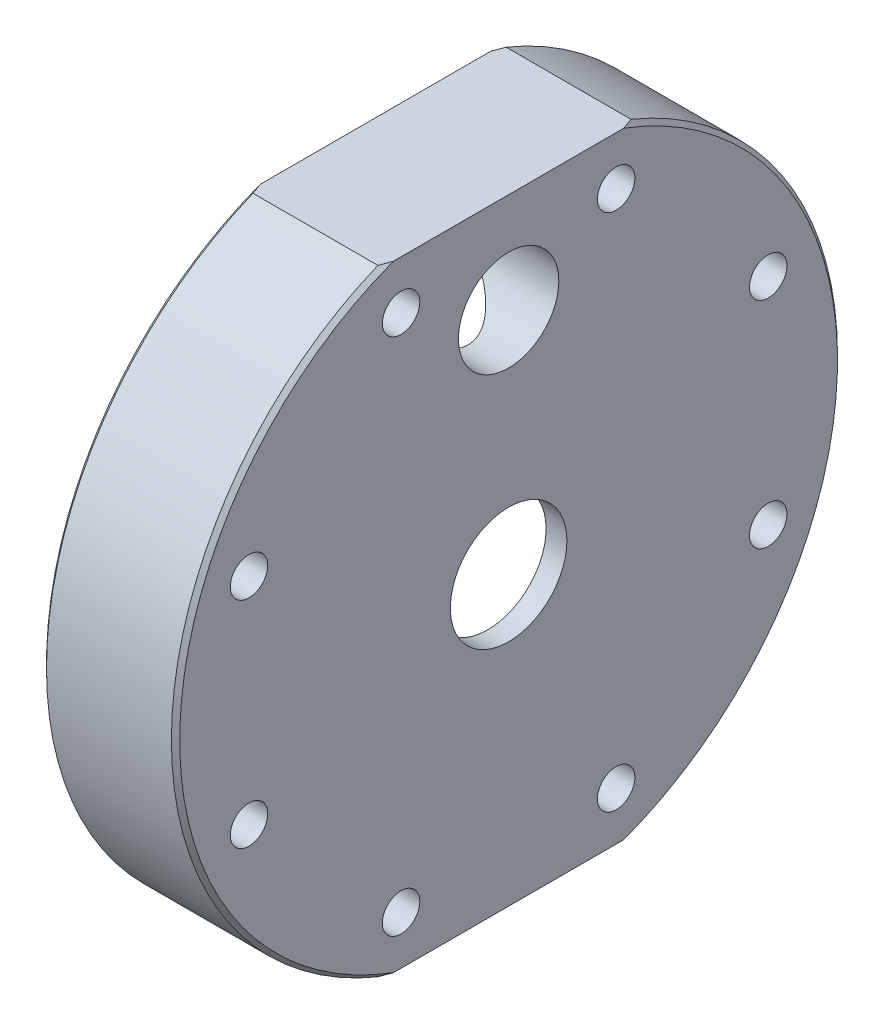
ISO-10303-21;
HEADER;
FILE_DESCRIPTION(('STEP AP214'),'2;1');
FILE_NAME('part.step','',(''),(''),'','','');
FILE_SCHEMA(('AUTOMOTIVE_DESIGN { 1 0 10303 214 1 1 1 1 }'));
ENDSEC;
DATA;
#1=APPLICATION_CONTEXT('core data for automotive mechanical design processes');
#2=APPLICATION_PROTOCOL_DEFINITION('international standard','automotive_design',2000,#1);
#3=PRODUCT_CONTEXT('',#1,'mechanical');
#4=PRODUCT('Part','Part','',(#3));
#5=PRODUCT_RELATED_PRODUCT_CATEGORY('part','',(#4));
#6=PRODUCT_DEFINITION_FORMATION('','',#4);
#7=PRODUCT_DEFINITION_CONTEXT('part definition',#1,'design');
#8=PRODUCT_DEFINITION('design','',#6,#7);
#9=PRODUCT_DEFINITION_SHAPE('','',#8);
#10=(LENGTH_UNIT() NAMED_UNIT(*) SI_UNIT(.MILLI.,.METRE.));
#11=(NAMED_UNIT(*) PLANE_ANGLE_UNIT() SI_UNIT($,.RADIAN.));
#12=(NAMED_UNIT(*) SI_UNIT($,.STERADIAN.) SOLID_ANGLE_UNIT());
#13=UNCERTAINTY_MEASURE_WITH_UNIT(LENGTH_MEASURE(1.E-05),#10,'distance_accuracy_value','');
#14=(GEOMETRIC_REPRESENTATION_CONTEXT(3) GLOBAL_UNCERTAINTY_ASSIGNED_CONTEXT((#13)) GLOBAL_UNIT_ASSIGNED_CONTEXT((#10,
#11,#12)) REPRESENTATION_CONTEXT('',''));
#15=CARTESIAN_POINT('',(0.,0.,0.));
#16=DIRECTION('',(0.,0.,1.));
#17=DIRECTION('',(1.,0.,0.));
#18=AXIS2_PLACEMENT_3D('',#15,#16,#17);
#19=CARTESIAN_POINT('',(13.104530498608,2.79017970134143,0.));
#20=DIRECTION('',(-1.,0.,0.));
#21=DIRECTION('',(0.,0.,1.));
#22=AXIS2_PLACEMENT_3D('',#19,#20,#21);
#23=CYLINDRICAL_SURFACE('',#22,80.);
#24=DIRECTION('',(-1.,0.,0.));
#25=VECTOR('',#24,1.);
#26=CARTESIAN_POINT('',(13.104530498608,-71.2098202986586,-30.3973683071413));
#27=LINE('',#26,#25);
#28=CARTESIAN_POINT('',(33.3710518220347,-71.2098202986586,-30.3973683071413));
#29=VERTEX_POINT('',#28);
#30=CARTESIAN_POINT('',(3.37105182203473,-71.2098202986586,-30.3973683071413));
#31=VERTEX_POINT('',#30);
#32=EDGE_CURVE('E134',#29,#31,#27,.T.);
#33=ORIENTED_EDGE('',*,*,#32,.T.);
#34=CARTESIAN_POINT('',(3.37105182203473,2.79017970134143,0.));
#35=DIRECTION('',(1.,0.,0.));
#36=DIRECTION('',(0.,0.,-1.));
#37=AXIS2_PLACEMENT_3D('',#34,#35,#36);
#38=CIRCLE('',#37,80.);
#39=CARTESIAN_POINT('',(3.37105182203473,76.7901797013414,-30.3973683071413));
#40=VERTEX_POINT('',#39);
#41=EDGE_CURVE('E234',#31,#40,#38,.T.);
#42=ORIENTED_EDGE('',*,*,#41,.T.);
#43=DIRECTION('',(-1.,0.,0.));
#44=VECTOR('',#43,1.);
#45=CARTESIAN_POINT('',(13.104530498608,76.7901797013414,-30.3973683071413));
#46=LINE('',#45,#44);
#47=CARTESIAN_POINT('',(33.3710518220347,76.7901797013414,-30.3973683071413));
#48=VERTEX_POINT('',#47);
#49=EDGE_CURVE('E119',#40,#48,#46,.F.);
#50=ORIENTED_EDGE('',*,*,#49,.T.);
#51=CARTESIAN_POINT('',(33.3710518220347,2.79017970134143,0.));
#52=DIRECTION('',(-1.,0.,0.));
#53=DIRECTION('',(0.,0.,1.));
#54=AXIS2_PLACEMENT_3D('',#51,#52,#53);
#55=CIRCLE('',#54,80.);
#56=EDGE_CURVE('E235',#48,#29,#55,.T.);
#57=ORIENTED_EDGE('',*,*,#56,.T.);
#58=EDGE_LOOP('',(#33,#42,#50,#57));
#59=FACE_BOUND('',#58,.T.);
#60=ADVANCED_FACE('F33',(#59),#23,.T.);
#61=CARTESIAN_POINT('',(2.37105182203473,82.7901797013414,0.));
#62=DIRECTION('',(1.,0.,0.));
#63=DIRECTION('',(0.,0.,-1.));
#64=AXIS2_PLACEMENT_3D('',#61,#62,#63);
#65=PLANE('',#64);
#66=CARTESIAN_POINT('',(2.37105182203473,28.6213113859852,62.3618684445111));
#67=DIRECTION('',(1.,0.,0.));
#68=DIRECTION('',(0.,0.,-1.));
#69=AXIS2_PLACEMENT_3D('',#66,#67,#68);
#70=CIRCLE('',#69,4.50000000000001);
#71=CARTESIAN_POINT('',(2.37105182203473,28.6213113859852,57.8618684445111));
#72=VERTEX_POINT('',#71);
#73=EDGE_CURVE('E294',#72,#72,#70,.T.);
#74=ORIENTED_EDGE('',*,*,#73,.T.);
#75=EDGE_LOOP('',(#74));
#76=FACE_BOUND('',#75,.T.);
#77=CARTESIAN_POINT('',(2.37105182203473,-23.040951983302,62.3618684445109));
#78=DIRECTION('',(1.,0.,0.));
#79=DIRECTION('',(0.,0.,-1.));
#80=AXIS2_PLACEMENT_3D('',#77,#78,#79);
#81=CIRCLE('',#80,4.5);
#82=CARTESIAN_POINT('',(2.37105182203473,-23.040951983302,57.8618684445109));
#83=VERTEX_POINT('',#82);
#84=EDGE_CURVE('E288',#83,#83,#81,.T.);
#85=ORIENTED_EDGE('',*,*,#84,.T.);
#86=EDGE_LOOP('',(#85));
#87=FACE_BOUND('',#86,.T.);
#88=CARTESIAN_POINT('',(2.37105182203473,-59.5716887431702,25.8311316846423));
#89=DIRECTION('',(1.,0.,0.));
#90=DIRECTION('',(0.,0.,-1.));
#91=AXIS2_PLACEMENT_3D('',#88,#89,#90);
#92=CIRCLE('',#91,4.5);
#93=CARTESIAN_POINT('',(2.37105182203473,-59.5716887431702,21.3311316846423));
#94=VERTEX_POINT('',#93);
#95=EDGE_CURVE('E282',#94,#94,#92,.T.);
#96=ORIENTED_EDGE('',*,*,#95,.T.);
#97=EDGE_LOOP('',(#96));
#98=FACE_BOUND('',#97,.T.);
#99=CARTESIAN_POINT('',(2.37105182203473,-59.5716887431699,-25.8311316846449));
#100=DIRECTION('',(1.,0.,0.));
#101=DIRECTION('',(0.,0.,-1.));
#102=AXIS2_PLACEMENT_3D('',#99,#100,#101);
#103=CIRCLE('',#102,4.5);
#104=CARTESIAN_POINT('',(2.37105182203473,-59.5716887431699,-30.3311316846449));
#105=VERTEX_POINT('',#104);
#106=EDGE_CURVE('E276',#105,#105,#103,.T.);
#107=ORIENTED_EDGE('',*,*,#106,.T.);
#108=EDGE_LOOP('',(#107));
#109=FACE_BOUND('',#108,.T.);
#110=CARTESIAN_POINT('',(2.37105182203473,-23.0409519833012,-62.361868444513));
#111=DIRECTION('',(1.,0.,0.));
#112=DIRECTION('',(0.,0.,-1.));
#113=AXIS2_PLACEMENT_3D('',#110,#111,#112);
#114=CIRCLE('',#113,4.49999999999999);
#115=CARTESIAN_POINT('',(2.37105182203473,-23.0409519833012,-66.861868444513));
#116=VERTEX_POINT('',#115);
#117=EDGE_CURVE('E270',#116,#116,#114,.T.);
#118=ORIENTED_EDGE('',*,*,#117,.T.);
#119=EDGE_LOOP('',(#118));
#120=FACE_BOUND('',#119,.T.);
#121=CARTESIAN_POINT('',(2.37105182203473,28.621311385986,-62.3618684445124));
#122=DIRECTION('',(1.,0.,0.));
#123=DIRECTION('',(0.,0.,-1.));
#124=AXIS2_PLACEMENT_3D('',#121,#122,#123);
#125=CIRCLE('',#124,4.5);
#126=CARTESIAN_POINT('',(2.37105182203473,28.621311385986,-66.8618684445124));
#127=VERTEX_POINT('',#126);
#128=EDGE_CURVE('E264',#127,#127,#125,.T.);
#129=ORIENTED_EDGE('',*,*,#128,.T.);
#130=EDGE_LOOP('',(#129));
#131=FACE_BOUND('',#130,.T.);
#132=CARTESIAN_POINT('',(2.37105182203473,65.152048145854,-25.8311316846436));
#133=DIRECTION('',(1.,0.,0.));
#134=DIRECTION('',(0.,0.,-1.));
#135=AXIS2_PLACEMENT_3D('',#132,#133,#134);
#136=CIRCLE('',#135,4.5);
#137=CARTESIAN_POINT('',(2.37105182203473,65.152048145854,-30.3311316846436));
#138=VERTEX_POINT('',#137);
#139=EDGE_CURVE('E258',#138,#138,#136,.T.);
#140=ORIENTED_EDGE('',*,*,#139,.T.);
#141=EDGE_LOOP('',(#140));
#142=FACE_BOUND('',#141,.T.);
#143=CARTESIAN_POINT('',(2.37105182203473,65.1520481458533,25.8311316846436));
#144=DIRECTION('',(1.,0.,0.));
#145=DIRECTION('',(0.,0.,-1.));
#146=AXIS2_PLACEMENT_3D('',#143,#144,#145);
#147=CIRCLE('',#146,4.5);
#148=CARTESIAN_POINT('',(2.37105182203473,65.1520481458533,21.3311316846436));
#149=VERTEX_POINT('',#148);
#150=EDGE_CURVE('E227',#149,#149,#147,.T.);
#151=ORIENTED_EDGE('',*,*,#150,.T.);
#152=EDGE_LOOP('',(#151));
#153=FACE_BOUND('',#152,.T.);
#154=CARTESIAN_POINT('',(2.37105182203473,2.79017970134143,0.));
#155=DIRECTION('',(-1.,0.,0.));
#156=DIRECTION('',(0.,0.,1.));
#157=AXIS2_PLACEMENT_3D('',#154,#155,#156);
#158=CIRCLE('',#157,60.2472791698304);
#159=CARTESIAN_POINT('',(2.37105182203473,62.6334519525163,-6.9654442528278));
#160=VERTEX_POINT('',#159);
#161=CARTESIAN_POINT('',(2.37105182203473,62.6334519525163,6.9654442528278));
#162=VERTEX_POINT('',#161);
#163=EDGE_CURVE('E115',#160,#162,#158,.T.);
#164=ORIENTED_EDGE('',*,*,#163,.F.);
#165=CARTESIAN_POINT('',(2.37105182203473,52.7901797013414,0.));
#166=DIRECTION('',(1.,0.,0.));
#167=DIRECTION('',(0.,0.,-1.));
#168=AXIS2_PLACEMENT_3D('',#165,#166,#167);
#169=CIRCLE('',#168,12.0585);
#170=EDGE_CURVE('E107',#160,#162,#169,.T.);
#171=ORIENTED_EDGE('',*,*,#170,.T.);
#172=EDGE_LOOP('',(#164,#171));
#173=FACE_BOUND('',#172,.T.);
#174=DIRECTION('',(0.,0.,-1.));
#175=VECTOR('',#174,1.);
#176=CARTESIAN_POINT('',(2.37105182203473,76.7901797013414,50.3104202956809));
#177=LINE('',#176,#175);
#178=CARTESIAN_POINT('',(2.37105182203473,76.7901797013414,27.6586333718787));
#179=VERTEX_POINT('',#178);
#180=CARTESIAN_POINT('',(2.37105182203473,76.7901797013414,-27.6586333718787));
#181=VERTEX_POINT('',#180);
#182=EDGE_CURVE('E126',#179,#181,#177,.T.);
#183=ORIENTED_EDGE('',*,*,#182,.T.);
#184=CARTESIAN_POINT('',(2.37105182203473,2.79017970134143,0.));
#185=DIRECTION('',(1.,0.,0.));
#186=DIRECTION('',(0.,0.,-1.));
#187=AXIS2_PLACEMENT_3D('',#184,#185,#186);
#188=CIRCLE('',#187,79.);
#189=CARTESIAN_POINT('',(2.37105182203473,-71.2098202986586,-27.6586333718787));
#190=VERTEX_POINT('',#189);
#191=EDGE_CURVE('E140',#181,#190,#188,.F.);
#192=ORIENTED_EDGE('',*,*,#191,.T.);
#193=DIRECTION('',(0.,0.,1.));
#194=VECTOR('',#193,1.);
#195=CARTESIAN_POINT('',(2.37105182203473,-71.2098202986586,71.0110619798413));
#196=LINE('',#195,#194);
#197=CARTESIAN_POINT('',(2.37105182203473,-71.2098202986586,27.6586333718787));
#198=VERTEX_POINT('',#197);
#199=EDGE_CURVE('E226',#190,#198,#196,.T.);
#200=ORIENTED_EDGE('',*,*,#199,.T.);
#201=CARTESIAN_POINT('',(2.37105182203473,2.79017970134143,0.));
#202=DIRECTION('',(1.,0.,0.));
#203=DIRECTION('',(0.,0.,-1.));
#204=AXIS2_PLACEMENT_3D('',#201,#202,#203);
#205=CIRCLE('',#204,79.);
#206=EDGE_CURVE('E137',#198,#179,#205,.F.);
#207=ORIENTED_EDGE('',*,*,#206,.T.);
#208=EDGE_LOOP('',(#183,#192,#200,#207));
#209=FACE_BOUND('',#208,.T.);
#210=ADVANCED_FACE('F35',(#76,#87,#98,#109,#120,#131,#142,#153,#173,#209),#65,.F.);
#211=CARTESIAN_POINT('',(2.37105182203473,2.79017970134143,0.));
#212=DIRECTION('',(-1.,0.,0.));
#213=DIRECTION('',(0.,0.,1.));
#214=AXIS2_PLACEMENT_3D('',#211,#212,#213);
#215=CONICAL_SURFACE('',#214,60.2472791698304,0.785398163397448);
#216=CARTESIAN_POINT('',(29.3710518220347,2.79017970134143,0.));
#217=DIRECTION('',(-1.,0.,0.));
#218=DIRECTION('',(0.,0.,1.));
#219=AXIS2_PLACEMENT_3D('',#216,#217,#218);
#220=CIRCLE('',#219,33.2472791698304);
#221=CARTESIAN_POINT('',(29.3710518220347,2.79017970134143,33.2472791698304));
#222=VERTEX_POINT('',#221);
#223=EDGE_CURVE('E120',#222,#222,#220,.T.);
#224=ORIENTED_EDGE('',*,*,#223,.F.);
#225=EDGE_LOOP('',(#224));
#226=FACE_BOUND('',#225,.T.);
#227=ORIENTED_EDGE('',*,*,#163,.T.);
#228=CARTESIAN_POINT('',(2.37085182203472,62.633692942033,6.96510368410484));
#229=CARTESIAN_POINT('',(2.55074119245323,62.4169238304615,7.27146430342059));
#230=CARTESIAN_POINT('',(2.74082550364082,62.188862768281,7.5634443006));
#231=CARTESIAN_POINT('',(3.13852075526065,61.7141922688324,8.11802611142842));
#232=CARTESIAN_POINT('',(3.34610312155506,61.4676131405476,8.38067425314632));
#233=CARTESIAN_POINT('',(3.77476721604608,60.9612989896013,8.87493258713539));
#234=CARTESIAN_POINT('',(3.99572490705,60.7016877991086,9.1067786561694));
#235=CARTESIAN_POINT('',(4.45064653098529,60.170382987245,9.5424371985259));
#236=CARTESIAN_POINT('',(4.68461728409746,59.8986830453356,9.74623477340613));
#237=CARTESIAN_POINT('',(5.22298409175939,59.2774715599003,10.1733773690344));
#238=CARTESIAN_POINT('',(5.53046769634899,58.9253581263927,10.3890576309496));
#239=CARTESIAN_POINT('',(6.1595381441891,58.2110684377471,10.7790079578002));
#240=CARTESIAN_POINT('',(6.48112637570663,57.8488911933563,10.9532739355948));
#241=CARTESIAN_POINT('',(7.13704901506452,57.1167525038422,11.2626241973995));
#242=CARTESIAN_POINT('',(7.4714268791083,56.7467668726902,11.3975583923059));
#243=CARTESIAN_POINT('',(8.14954405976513,56.0034427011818,11.6290118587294));
#244=CARTESIAN_POINT('',(8.49328401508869,55.6301039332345,11.7255285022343));
#245=CARTESIAN_POINT('',(9.27345185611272,54.7909961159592,11.9008484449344));
#246=CARTESIAN_POINT('',(9.71194104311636,54.3250083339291,11.9695063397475));
#247=CARTESIAN_POINT('',(10.5972491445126,53.3960743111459,12.0522961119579));
#248=CARTESIAN_POINT('',(11.0440699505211,52.9331287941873,12.0664154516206));
#249=CARTESIAN_POINT('',(11.9432536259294,52.0137181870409,12.0422624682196));
#250=CARTESIAN_POINT('',(12.3956186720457,51.5572558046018,12.0039688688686));
#251=CARTESIAN_POINT('',(13.3028892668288,50.6541757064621,11.8765674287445));
#252=CARTESIAN_POINT('',(13.7577945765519,50.2075570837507,11.7874642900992));
#253=CARTESIAN_POINT('',(14.6715945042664,49.3228942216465,11.5583772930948));
#254=CARTESIAN_POINT('',(15.1304869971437,48.8849679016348,11.4179292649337));
#255=CARTESIAN_POINT('',(16.0449635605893,48.0248005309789,11.0865267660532));
#256=CARTESIAN_POINT('',(16.5005469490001,47.602562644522,10.8955621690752));
#257=CARTESIAN_POINT('',(17.4039073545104,46.7775091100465,10.4628845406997));
#258=CARTESIAN_POINT('',(17.851694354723,46.3746672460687,10.2212425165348));
#259=CARTESIAN_POINT('',(18.7352306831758,45.5914230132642,9.68557452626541));
#260=CARTESIAN_POINT('',(19.1709866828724,45.2110080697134,9.39157829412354));
#261=CARTESIAN_POINT('',(19.8546824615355,44.6227377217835,8.87619278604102));
#262=CARTESIAN_POINT('',(20.1085290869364,44.4063142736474,8.67229173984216));
#263=CARTESIAN_POINT('',(20.6076550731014,43.9844525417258,8.24360598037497));
#264=CARTESIAN_POINT('',(20.8529348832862,43.7790136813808,8.01882236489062));
#265=CARTESIAN_POINT('',(21.3323016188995,43.3808936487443,7.54770051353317));
#266=CARTESIAN_POINT('',(21.5664001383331,43.1881991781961,7.30138538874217));
#267=CARTESIAN_POINT('',(22.0206541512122,42.8173039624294,6.78600937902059));
#268=CARTESIAN_POINT('',(22.240813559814,42.6390991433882,6.51695493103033));
#269=CARTESIAN_POINT('',(22.6068755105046,42.345030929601,6.03026507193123));
#270=CARTESIAN_POINT('',(22.7569006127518,42.2252332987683,5.81810073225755));
#271=CARTESIAN_POINT('',(23.0455570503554,41.9959417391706,5.3807801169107));
#272=CARTESIAN_POINT('',(23.1841886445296,41.8864475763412,5.15562413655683));
#273=CARTESIAN_POINT('',(23.447722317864,41.6792977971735,4.69254616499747));
#274=CARTESIAN_POINT('',(23.5726397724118,41.5816289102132,4.4546389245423));
#275=CARTESIAN_POINT('',(23.8064001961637,41.3996285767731,3.96618536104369));
#276=CARTESIAN_POINT('',(23.9152495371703,41.315291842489,3.71564410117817));
#277=CARTESIAN_POINT('',(24.0920928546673,41.1787557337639,3.2596995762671));
#278=CARTESIAN_POINT('',(24.1637923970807,41.1235781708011,3.05662152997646));
#279=CARTESIAN_POINT('',(24.294494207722,41.0232274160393,2.644101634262));
#280=CARTESIAN_POINT('',(24.3535036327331,40.9780485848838,2.4346634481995));
#281=CARTESIAN_POINT('',(24.4575899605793,40.8984998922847,2.01045035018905));
#282=CARTESIAN_POINT('',(24.5026749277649,40.8641237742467,1.79567860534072));
#283=CARTESIAN_POINT('',(24.5778814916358,40.8068492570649,1.36199971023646));
#284=CARTESIAN_POINT('',(24.6080030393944,40.7839508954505,1.14309254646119));
#285=CARTESIAN_POINT('',(24.6526086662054,40.7500611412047,0.701594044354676));
#286=CARTESIAN_POINT('',(24.6670098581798,40.7391328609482,0.478989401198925));
#287=CARTESIAN_POINT('',(24.6794882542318,40.7296629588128,0.0330560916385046));
#288=CARTESIAN_POINT('',(24.6775654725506,40.7311213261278,-0.19027257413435));
#289=CARTESIAN_POINT('',(24.6574489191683,40.7463901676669,-0.635809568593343));
#290=CARTESIAN_POINT('',(24.6392518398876,40.7602031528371,-0.858017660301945));
#291=CARTESIAN_POINT('',(24.5870869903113,40.7998539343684,-1.29947293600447));
#292=CARTESIAN_POINT('',(24.5531193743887,40.8256916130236,-1.51872014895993));
#293=CARTESIAN_POINT('',(24.4732731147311,40.8865451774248,-1.93709498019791));
#294=CARTESIAN_POINT('',(24.4284247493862,40.9207689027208,-2.13653694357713));
#295=CARTESIAN_POINT('',(24.3268131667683,40.9984831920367,-2.53054886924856));
#296=CARTESIAN_POINT('',(24.2700463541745,41.0419765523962,-2.72511734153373));
#297=CARTESIAN_POINT('',(24.083415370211,41.1853470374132,-3.3001838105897));
#298=CARTESIAN_POINT('',(23.9371841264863,41.2981422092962,-3.67222649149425));
#299=CARTESIAN_POINT('',(23.5187636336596,41.6232284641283,-4.588808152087));
#300=CARTESIAN_POINT('',(23.2216788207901,41.8560184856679,-5.11469457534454));
#301=CARTESIAN_POINT('',(22.7331753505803,42.2440909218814,-5.85366383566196));
#302=CARTESIAN_POINT('',(22.5628611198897,42.380200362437,-6.09204772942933));
#303=CARTESIAN_POINT('',(22.2103111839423,42.6638764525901,-6.55274513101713));
#304=CARTESIAN_POINT('',(22.0280756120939,42.8114429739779,-6.77505881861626));
#305=CARTESIAN_POINT('',(21.5563782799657,43.1961362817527,-7.31589244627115));
#306=CARTESIAN_POINT('',(21.2605371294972,43.4398534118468,-7.62415926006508));
#307=CARTESIAN_POINT('',(20.6522984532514,43.9466577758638,-8.20662013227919));
#308=CARTESIAN_POINT('',(20.3398926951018,44.209754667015,-8.48079701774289));
#309=CARTESIAN_POINT('',(19.7025639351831,44.752719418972,-8.99706259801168));
#310=CARTESIAN_POINT('',(19.3776261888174,45.0326072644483,-9.23911190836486));
#311=CARTESIAN_POINT('',(18.718928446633,45.6065952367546,-9.69211941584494));
#312=CARTESIAN_POINT('',(18.3851689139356,45.9006946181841,-9.9030792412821));
#313=CARTESIAN_POINT('',(17.5973212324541,46.6029879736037,-10.3612974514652));
#314=CARTESIAN_POINT('',(17.1407152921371,47.0161281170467,-10.5967003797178));
#315=CARTESIAN_POINT('',(16.2208834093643,47.8612191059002,-11.0152227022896));
#316=CARTESIAN_POINT('',(15.7576554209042,48.2931758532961,-11.1983255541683));
#317=CARTESIAN_POINT('',(14.8281343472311,49.1729731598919,-11.5126691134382));
#318=CARTESIAN_POINT('',(14.3618395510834,49.6208233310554,-11.6438778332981));
#319=CARTESIAN_POINT('',(13.4297711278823,50.5290777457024,-11.8537776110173));
#320=CARTESIAN_POINT('',(12.9639974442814,50.9894804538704,-11.9324750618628));
#321=CARTESIAN_POINT('',(12.0326846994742,51.9229982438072,-12.0365072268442));
#322=CARTESIAN_POINT('',(11.5671696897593,52.3961793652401,-12.0614678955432));
#323=CARTESIAN_POINT('',(10.642632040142,53.3487012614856,-12.0549709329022));
#324=CARTESIAN_POINT('',(10.1836104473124,53.828043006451,-12.023504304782));
#325=CARTESIAN_POINT('',(9.27587622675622,54.7882220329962,-11.9016491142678));
#326=CARTESIAN_POINT('',(8.8271542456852,55.2690574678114,-11.8113163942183));
#327=CARTESIAN_POINT('',(7.94343928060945,56.2275935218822,-11.5687431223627));
#328=CARTESIAN_POINT('',(7.50843963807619,56.705295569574,-11.4165331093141));
#329=CARTESIAN_POINT('',(6.79286652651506,57.5000893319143,-11.1060114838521));
#330=CARTESIAN_POINT('',(6.50739776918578,57.819686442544,-10.9652195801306));
#331=CARTESIAN_POINT('',(5.94645446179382,58.4523353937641,-10.65232059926));
#332=CARTESIAN_POINT('',(5.67097935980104,58.7653875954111,-10.4802152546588));
#333=CARTESIAN_POINT('',(5.13290135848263,59.381130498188,-10.104277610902));
#334=CARTESIAN_POINT('',(4.87025636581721,59.6838539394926,-9.90055971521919));
#335=CARTESIAN_POINT('',(4.35905267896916,60.276886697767,-9.46007882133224));
#336=CARTESIAN_POINT('',(4.11049249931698,60.5671973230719,-9.22331931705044));
#337=CARTESIAN_POINT('',(3.59604033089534,61.1716645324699,-8.68018072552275));
#338=CARTESIAN_POINT('',(3.3326449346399,61.4834131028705,-8.36869236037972));
#339=CARTESIAN_POINT('',(2.83122234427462,62.0804500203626,-7.70063512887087));
#340=CARTESIAN_POINT('',(2.59327973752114,62.3656497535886,-7.34392406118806));
#341=CARTESIAN_POINT('',(2.37085182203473,62.633692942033,-6.96510368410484));
#342=B_SPLINE_CURVE_WITH_KNOTS('',3,(#228,#229,#230,#231,#232,#233,#234,#235,#236,#237,#238,
#239,#240,#241,#242,#243,#244,#245,#246,#247,#248,#249,#250,#251,#252,#253,#254,#255,#256,#257,
#258,#259,#260,#261,#262,#263,#264,#265,#266,#267,#268,#269,#270,#271,#272,#273,#274,#275,#276,
#277,#278,#279,#280,#281,#282,#283,#284,#285,#286,#287,#288,#289,#290,#291,#292,#293,#294,#295,
#296,#297,#298,#299,#300,#301,#302,#303,#304,#305,#306,#307,#308,#309,#310,#311,#312,#313,#314,
#315,#316,#317,#318,#319,#320,#321,#322,#323,#324,#325,#326,#327,#328,#329,#330,#331,#332,#333,
#334,#335,#336,#337,#338,#339,#340,#341),.UNSPECIFIED.,.F.,.F.,(4,2,2,2,2,2,2,2,2,2,2,2,2,2,2,2,
2,2,2,2,2,2,2,2,2,2,2,2,2,2,2,2,2,2,2,2,2,2,2,2,2,2,2,2,2,2,2,2,2,2,2,2,2,2,2,2,4),(0.,
1.24758505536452,2.49317088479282,3.72858827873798,4.96465937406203,6.50694477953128,
8.04938232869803,9.59763095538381,11.1459854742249,13.0739779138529,15.0024135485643,
16.9316322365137,18.8606724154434,20.8076011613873,22.7549204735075,24.6995292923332,
26.6430371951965,27.8152536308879,28.9874084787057,30.1583202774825,31.3289017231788,
32.1866927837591,33.0444643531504,33.9012642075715,34.757723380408,35.4240722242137,
36.0900442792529,36.7556299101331,37.4212177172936,38.0902981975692,38.759378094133,
39.4285940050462,40.0978033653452,40.7189652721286,41.3403148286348,42.5824519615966,
44.5128866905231,45.4814785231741,46.4500595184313,47.9234966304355,49.3976730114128,
50.8736401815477,52.3495300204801,54.3245963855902,56.3002867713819,58.2771930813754,
60.2538586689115,62.2442393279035,64.2349373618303,66.223749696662,68.2115816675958,
69.5636744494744,70.9156924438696,72.2629270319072,73.6100192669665,75.1470196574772,
76.6889788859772),.UNSPECIFIED.);
#343=EDGE_CURVE('E104',#162,#160,#342,.T.);
#344=ORIENTED_EDGE('',*,*,#343,.T.);
#345=EDGE_LOOP('',(#227,#344));
#346=FACE_BOUND('',#345,.T.);
#347=ADVANCED_FACE('F118',(#226,#346),#215,.F.);
#348=CARTESIAN_POINT('',(29.3710518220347,2.79017970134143,0.));
#349=DIRECTION('',(1.,0.,0.));
#350=DIRECTION('',(0.,0.,-1.));
#351=AXIS2_PLACEMENT_3D('',#348,#349,#350);
#352=PLANE('',#351);
#353=CARTESIAN_POINT('',(29.3710518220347,-2.20982029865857,0.));
#354=DIRECTION('',(1.,0.,0.));
#355=DIRECTION('',(0.,0.,-1.));
#356=AXIS2_PLACEMENT_3D('',#353,#354,#355);
#357=CIRCLE('',#356,14.);
#358=CARTESIAN_POINT('',(29.3710518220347,-2.20982029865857,-14.));
#359=VERTEX_POINT('',#358);
#360=EDGE_CURVE('E388',#359,#359,#357,.T.);
#361=ORIENTED_EDGE('',*,*,#360,.T.);
#362=EDGE_LOOP('',(#361));
#363=FACE_BOUND('',#362,.T.);
#364=ORIENTED_EDGE('',*,*,#223,.T.);
#365=EDGE_LOOP('',(#364));
#366=FACE_BOUND('',#365,.T.);
#367=ADVANCED_FACE('F353',(#363,#366),#352,.F.);
#368=CARTESIAN_POINT('',(34.3710518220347,82.7901797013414,0.));
#369=DIRECTION('',(-1.,0.,0.));
#370=DIRECTION('',(0.,0.,1.));
#371=AXIS2_PLACEMENT_3D('',#368,#369,#370);
#372=PLANE('',#371);
#373=CARTESIAN_POINT('',(34.3710518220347,-2.20982029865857,0.));
#374=DIRECTION('',(1.,0.,0.));
#375=DIRECTION('',(0.,0.,-1.));
#376=AXIS2_PLACEMENT_3D('',#373,#374,#375);
#377=CIRCLE('',#376,14.);
#378=CARTESIAN_POINT('',(34.3710518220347,-2.20982029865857,-14.));
#379=VERTEX_POINT('',#378);
#380=EDGE_CURVE('E362',#379,#379,#377,.T.);
#381=ORIENTED_EDGE('',*,*,#380,.F.);
#382=EDGE_LOOP('',(#381));
#383=FACE_BOUND('',#382,.T.);
#384=CARTESIAN_POINT('',(34.3710518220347,52.7901797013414,0.));
#385=DIRECTION('',(1.,0.,0.));
#386=DIRECTION('',(0.,0.,-1.));
#387=AXIS2_PLACEMENT_3D('',#384,#385,#386);
#388=CIRCLE('',#387,12.0585);
#389=CARTESIAN_POINT('',(34.3710518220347,52.7901797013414,-12.0585));
#390=VERTEX_POINT('',#389);
#391=EDGE_CURVE('E116',#390,#390,#388,.T.);
#392=ORIENTED_EDGE('',*,*,#391,.F.);
#393=EDGE_LOOP('',(#392));
#394=FACE_BOUND('',#393,.T.);
#395=CARTESIAN_POINT('',(34.3710518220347,28.6213113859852,62.3618684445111));
#396=DIRECTION('',(1.,0.,0.));
#397=DIRECTION('',(0.,0.,-1.));
#398=AXIS2_PLACEMENT_3D('',#395,#396,#397);
#399=CIRCLE('',#398,4.50000000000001);
#400=CARTESIAN_POINT('',(34.3710518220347,28.6213113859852,57.8618684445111));
#401=VERTEX_POINT('',#400);
#402=EDGE_CURVE('E111',#401,#401,#399,.T.);
#403=ORIENTED_EDGE('',*,*,#402,.F.);
#404=EDGE_LOOP('',(#403));
#405=FACE_BOUND('',#404,.T.);
#406=CARTESIAN_POINT('',(34.3710518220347,-23.040951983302,62.3618684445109));
#407=DIRECTION('',(1.,0.,0.));
#408=DIRECTION('',(0.,0.,-1.));
#409=AXIS2_PLACEMENT_3D('',#406,#407,#408);
#410=CIRCLE('',#409,4.5);
#411=CARTESIAN_POINT('',(34.3710518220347,-23.040951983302,57.8618684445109));
#412=VERTEX_POINT('',#411);
#413=EDGE_CURVE('E291',#412,#412,#410,.T.);
#414=ORIENTED_EDGE('',*,*,#413,.F.);
#415=EDGE_LOOP('',(#414));
#416=FACE_BOUND('',#415,.T.);
#417=CARTESIAN_POINT('',(34.3710518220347,-59.5716887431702,25.8311316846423));
#418=DIRECTION('',(1.,0.,0.));
#419=DIRECTION('',(0.,0.,-1.));
#420=AXIS2_PLACEMENT_3D('',#417,#418,#419);
#421=CIRCLE('',#420,4.5);
#422=CARTESIAN_POINT('',(34.3710518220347,-59.5716887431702,21.3311316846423));
#423=VERTEX_POINT('',#422);
#424=EDGE_CURVE('E285',#423,#423,#421,.T.);
#425=ORIENTED_EDGE('',*,*,#424,.F.);
#426=EDGE_LOOP('',(#425));
#427=FACE_BOUND('',#426,.T.);
#428=CARTESIAN_POINT('',(34.3710518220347,-59.5716887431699,-25.8311316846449));
#429=DIRECTION('',(1.,0.,0.));
#430=DIRECTION('',(0.,0.,-1.));
#431=AXIS2_PLACEMENT_3D('',#428,#429,#430);
#432=CIRCLE('',#431,4.5);
#433=CARTESIAN_POINT('',(34.3710518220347,-59.5716887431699,-30.3311316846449));
#434=VERTEX_POINT('',#433);
#435=EDGE_CURVE('E279',#434,#434,#432,.T.);
#436=ORIENTED_EDGE('',*,*,#435,.F.);
#437=EDGE_LOOP('',(#436));
#438=FACE_BOUND('',#437,.T.);
#439=CARTESIAN_POINT('',(34.3710518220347,-23.0409519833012,-62.361868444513));
#440=DIRECTION('',(1.,0.,0.));
#441=DIRECTION('',(0.,0.,-1.));
#442=AXIS2_PLACEMENT_3D('',#439,#440,#441);
#443=CIRCLE('',#442,4.49999999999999);
#444=CARTESIAN_POINT('',(34.3710518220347,-23.0409519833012,-66.861868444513));
#445=VERTEX_POINT('',#444);
#446=EDGE_CURVE('E273',#445,#445,#443,.T.);
#447=ORIENTED_EDGE('',*,*,#446,.F.);
#448=EDGE_LOOP('',(#447));
#449=FACE_BOUND('',#448,.T.);
#450=CARTESIAN_POINT('',(34.3710518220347,28.621311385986,-62.3618684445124));
#451=DIRECTION('',(1.,0.,0.));
#452=DIRECTION('',(0.,0.,-1.));
#453=AXIS2_PLACEMENT_3D('',#450,#451,#452);
#454=CIRCLE('',#453,4.5);
#455=CARTESIAN_POINT('',(34.3710518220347,28.621311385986,-66.8618684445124));
#456=VERTEX_POINT('',#455);
#457=EDGE_CURVE('E267',#456,#456,#454,.T.);
#458=ORIENTED_EDGE('',*,*,#457,.F.);
#459=EDGE_LOOP('',(#458));
#460=FACE_BOUND('',#459,.T.);
#461=CARTESIAN_POINT('',(34.3710518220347,65.152048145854,-25.8311316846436));
#462=DIRECTION('',(1.,0.,0.));
#463=DIRECTION('',(0.,0.,-1.));
#464=AXIS2_PLACEMENT_3D('',#461,#462,#463);
#465=CIRCLE('',#464,4.5);
#466=CARTESIAN_POINT('',(34.3710518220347,65.152048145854,-30.3311316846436));
#467=VERTEX_POINT('',#466);
#468=EDGE_CURVE('E261',#467,#467,#465,.T.);
#469=ORIENTED_EDGE('',*,*,#468,.F.);
#470=EDGE_LOOP('',(#469));
#471=FACE_BOUND('',#470,.T.);
#472=CARTESIAN_POINT('',(34.3710518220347,65.1520481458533,25.8311316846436));
#473=DIRECTION('',(1.,0.,0.));
#474=DIRECTION('',(0.,0.,-1.));
#475=AXIS2_PLACEMENT_3D('',#472,#473,#474);
#476=CIRCLE('',#475,4.5);
#477=CARTESIAN_POINT('',(34.3710518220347,65.1520481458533,21.3311316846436));
#478=VERTEX_POINT('',#477);
#479=EDGE_CURVE('E255',#478,#478,#476,.T.);
#480=ORIENTED_EDGE('',*,*,#479,.F.);
#481=EDGE_LOOP('',(#480));
#482=FACE_BOUND('',#481,.T.);
#483=DIRECTION('',(0.,0.,1.));
#484=VECTOR('',#483,1.);
#485=CARTESIAN_POINT('',(34.3710518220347,-71.2098202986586,71.0110619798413));
#486=LINE('',#485,#484);
#487=CARTESIAN_POINT('',(34.3710518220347,-71.2098202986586,-27.6586333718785));
#488=VERTEX_POINT('',#487);
#489=CARTESIAN_POINT('',(34.3710518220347,-71.2098202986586,27.6586333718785));
#490=VERTEX_POINT('',#489);
#491=EDGE_CURVE('E218',#488,#490,#486,.T.);
#492=ORIENTED_EDGE('',*,*,#491,.F.);
#493=CARTESIAN_POINT('',(34.3710518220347,2.79017970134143,0.));
#494=DIRECTION('',(-1.,0.,0.));
#495=DIRECTION('',(0.,0.,1.));
#496=AXIS2_PLACEMENT_3D('',#493,#494,#495);
#497=CIRCLE('',#496,79.);
#498=CARTESIAN_POINT('',(34.3710518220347,76.7901797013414,-27.6586333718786));
#499=VERTEX_POINT('',#498);
#500=EDGE_CURVE('E11',#488,#499,#497,.F.);
#501=ORIENTED_EDGE('',*,*,#500,.T.);
#502=DIRECTION('',(0.,0.,-1.));
#503=VECTOR('',#502,1.);
#504=CARTESIAN_POINT('',(34.3710518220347,76.7901797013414,50.3104202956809));
#505=LINE('',#504,#503);
#506=CARTESIAN_POINT('',(34.3710518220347,76.7901797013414,27.6586333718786));
#507=VERTEX_POINT('',#506);
#508=EDGE_CURVE('E221',#507,#499,#505,.T.);
#509=ORIENTED_EDGE('',*,*,#508,.F.);
#510=CARTESIAN_POINT('',(34.3710518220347,2.79017970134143,0.));
#511=DIRECTION('',(-1.,0.,0.));
#512=DIRECTION('',(0.,0.,1.));
#513=AXIS2_PLACEMENT_3D('',#510,#511,#512);
#514=CIRCLE('',#513,79.);
#515=EDGE_CURVE('E41',#507,#490,#514,.F.);
#516=ORIENTED_EDGE('',*,*,#515,.T.);
#517=EDGE_LOOP('',(#492,#501,#509,#516));
#518=FACE_BOUND('',#517,.T.);
#519=ADVANCED_FACE('F217',(#383,#394,#405,#416,#427,#438,#449,#460,#471,#482,#518),#372,.F.);
#520=DIRECTION('',(-1.,0.,0.));
#521=VECTOR('',#520,1.);
#522=CARTESIAN_POINT('',(13.104530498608,76.7901797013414,30.3973683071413));
#523=LINE('',#522,#521);
#524=CARTESIAN_POINT('',(33.3710518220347,76.7901797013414,30.3973683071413));
#525=VERTEX_POINT('',#524);
#526=CARTESIAN_POINT('',(3.37105182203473,76.7901797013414,30.3973683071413));
#527=VERTEX_POINT('',#526);
#528=EDGE_CURVE('E123',#525,#527,#523,.T.);
#529=ORIENTED_EDGE('',*,*,#528,.T.);
#530=CARTESIAN_POINT('',(3.37105182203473,2.79017970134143,0.));
#531=DIRECTION('',(1.,0.,0.));
#532=DIRECTION('',(0.,0.,-1.));
#533=AXIS2_PLACEMENT_3D('',#530,#531,#532);
#534=CIRCLE('',#533,80.);
#535=CARTESIAN_POINT('',(3.37105182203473,-71.2098202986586,30.3973683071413));
#536=VERTEX_POINT('',#535);
#537=EDGE_CURVE('E212',#527,#536,#534,.T.);
#538=ORIENTED_EDGE('',*,*,#537,.T.);
#539=DIRECTION('',(-1.,0.,0.));
#540=VECTOR('',#539,1.);
#541=CARTESIAN_POINT('',(13.104530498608,-71.2098202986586,30.3973683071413));
#542=LINE('',#541,#540);
#543=CARTESIAN_POINT('',(33.3710518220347,-71.2098202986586,30.3973683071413));
#544=VERTEX_POINT('',#543);
#545=EDGE_CURVE('E131',#536,#544,#542,.F.);
#546=ORIENTED_EDGE('',*,*,#545,.T.);
#547=CARTESIAN_POINT('',(33.3710518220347,2.79017970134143,0.));
#548=DIRECTION('',(-1.,0.,0.));
#549=DIRECTION('',(0.,0.,1.));
#550=AXIS2_PLACEMENT_3D('',#547,#548,#549);
#551=CIRCLE('',#550,80.);
#552=EDGE_CURVE('E210',#544,#525,#551,.T.);
#553=ORIENTED_EDGE('',*,*,#552,.T.);
#554=EDGE_LOOP('',(#529,#538,#546,#553));
#555=FACE_BOUND('',#554,.T.);
#556=ADVANCED_FACE('F230',(#555),#23,.T.);
#557=CARTESIAN_POINT('',(2.37105182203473,76.7901797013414,50.3104202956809));
#558=DIRECTION('',(0.,-1.,0.));
#559=DIRECTION('',(0.,0.,-1.));
#560=AXIS2_PLACEMENT_3D('',#557,#558,#559);
#561=PLANE('',#560);
#562=ORIENTED_EDGE('',*,*,#49,.F.);
#563=CARTESIAN_POINT('',(3.37105182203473,76.7901797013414,-30.3973683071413));
#564=CARTESIAN_POINT('',(3.28474828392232,76.7901797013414,-30.1702340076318));
#565=CARTESIAN_POINT('',(3.19916788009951,76.7901797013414,-29.9428247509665));
#566=CARTESIAN_POINT('',(3.02948545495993,76.7901797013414,-29.4874666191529));
#567=CARTESIAN_POINT('',(2.94538336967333,76.7901797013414,-29.2595177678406));
#568=CARTESIAN_POINT('',(2.77868212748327,76.7901797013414,-28.8030708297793));
#569=CARTESIAN_POINT('',(2.69608297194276,76.7901797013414,-28.5745727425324));
#570=CARTESIAN_POINT('',(2.53241296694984,76.7901797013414,-28.1170187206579));
#571=CARTESIAN_POINT('',(2.4513421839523,76.7901797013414,-27.8879627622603));
#572=CARTESIAN_POINT('',(2.37105182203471,76.7901797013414,-27.6586333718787));
#573=B_SPLINE_CURVE_WITH_KNOTS('',3,(#563,#564,#565,#566,#567,#568,#569,#570,#571,#572),
.UNSPECIFIED.,.F.,.F.,(4,2,2,2,4),(0.,0.728932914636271,1.45783420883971,2.18673616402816,
2.91566973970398),.UNSPECIFIED.);
#574=EDGE_CURVE('E200',#40,#181,#573,.T.);
#575=ORIENTED_EDGE('',*,*,#574,.T.);
#576=ORIENTED_EDGE('',*,*,#182,.F.);
#577=CARTESIAN_POINT('',(2.37105182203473,76.7901797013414,27.6586333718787));
#578=CARTESIAN_POINT('',(2.45134218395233,76.7901797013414,27.8879627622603));
#579=CARTESIAN_POINT('',(2.53241296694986,76.7901797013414,28.1170187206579));
#580=CARTESIAN_POINT('',(2.69608297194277,76.7901797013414,28.5745727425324));
#581=CARTESIAN_POINT('',(2.77868212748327,76.7901797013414,28.8030708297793));
#582=CARTESIAN_POINT('',(2.94538336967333,76.7901797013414,29.2595177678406));
#583=CARTESIAN_POINT('',(3.02948545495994,76.7901797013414,29.4874666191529));
#584=CARTESIAN_POINT('',(3.19916788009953,76.7901797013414,29.9428247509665));
#585=CARTESIAN_POINT('',(3.28474828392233,76.7901797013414,30.1702340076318));
#586=CARTESIAN_POINT('',(3.37105182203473,76.7901797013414,30.3973683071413));
#587=B_SPLINE_CURVE_WITH_KNOTS('',3,(#577,#578,#579,#580,#581,#582,#583,#584,#585,#586),
.UNSPECIFIED.,.F.,.F.,(4,2,2,2,4),(0.,0.728933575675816,1.45783553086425,2.18673682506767,
2.91566973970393),.UNSPECIFIED.);
#588=EDGE_CURVE('E48',#179,#527,#587,.T.);
#589=ORIENTED_EDGE('',*,*,#588,.T.);
#590=ORIENTED_EDGE('',*,*,#528,.F.);
#591=CARTESIAN_POINT('',(33.3710518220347,76.7901797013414,30.3973683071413));
#592=CARTESIAN_POINT('',(33.4573553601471,76.7901797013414,30.1702340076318));
#593=CARTESIAN_POINT('',(33.5429357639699,76.7901797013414,29.9428247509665));
#594=CARTESIAN_POINT('',(33.7126181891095,76.7901797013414,29.4874666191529));
#595=CARTESIAN_POINT('',(33.7967202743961,76.7901797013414,29.2595177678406));
#596=CARTESIAN_POINT('',(33.9634215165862,76.7901797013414,28.8030708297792));
#597=CARTESIAN_POINT('',(34.0460206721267,76.7901797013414,28.5745727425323));
#598=CARTESIAN_POINT('',(34.2096906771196,76.7901797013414,28.1170187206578));
#599=CARTESIAN_POINT('',(34.2907614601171,76.7901797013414,27.8879627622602));
#600=CARTESIAN_POINT('',(34.3710518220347,76.7901797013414,27.6586333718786));
#601=B_SPLINE_CURVE_WITH_KNOTS('',3,(#591,#592,#593,#594,#595,#596,#597,#598,#599,#600),
.UNSPECIFIED.,.F.,.F.,(4,2,2,2,4),(0.,0.728932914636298,1.45783420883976,2.18673616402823,
2.91566973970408),.UNSPECIFIED.);
#602=EDGE_CURVE('E56',#525,#507,#601,.T.);
#603=ORIENTED_EDGE('',*,*,#602,.T.);
#604=ORIENTED_EDGE('',*,*,#508,.T.);
#605=CARTESIAN_POINT('',(34.3710518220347,76.7901797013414,-27.6586333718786));
#606=CARTESIAN_POINT('',(34.2907614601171,76.7901797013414,-27.8879627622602));
#607=CARTESIAN_POINT('',(34.2096906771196,76.7901797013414,-28.1170187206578));
#608=CARTESIAN_POINT('',(34.0460206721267,76.7901797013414,-28.5745727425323));
#609=CARTESIAN_POINT('',(33.9634215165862,76.7901797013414,-28.8030708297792));
#610=CARTESIAN_POINT('',(33.7967202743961,76.7901797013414,-29.2595177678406));
#611=CARTESIAN_POINT('',(33.7126181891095,76.7901797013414,-29.4874666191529));
#612=CARTESIAN_POINT('',(33.5429357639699,76.7901797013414,-29.9428247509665));
#613=CARTESIAN_POINT('',(33.4573553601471,76.7901797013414,-30.1702340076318));
#614=CARTESIAN_POINT('',(33.3710518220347,76.7901797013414,-30.3973683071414));
#615=B_SPLINE_CURVE_WITH_KNOTS('',3,(#605,#606,#607,#608,#609,#610,#611,#612,#613,#614),
.UNSPECIFIED.,.F.,.F.,(4,2,2,2,4),(0.,0.728933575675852,1.45783553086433,2.18673682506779,
2.91566973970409),.UNSPECIFIED.);
#616=EDGE_CURVE('E201',#499,#48,#615,.T.);
#617=ORIENTED_EDGE('',*,*,#616,.T.);
#618=EDGE_LOOP('',(#562,#575,#576,#589,#590,#603,#604,#617));
#619=FACE_BOUND('',#618,.T.);
#620=ADVANCED_FACE('F164',(#619),#561,.F.);
#621=CARTESIAN_POINT('',(2.37105182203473,-71.2098202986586,71.0110619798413));
#622=DIRECTION('',(0.,1.,0.));
#623=DIRECTION('',(0.,0.,1.));
#624=AXIS2_PLACEMENT_3D('',#621,#622,#623);
#625=PLANE('',#624);
#626=ORIENTED_EDGE('',*,*,#199,.F.);
#627=CARTESIAN_POINT('',(2.37105182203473,-71.2098202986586,-27.6586333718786));
#628=CARTESIAN_POINT('',(2.45134218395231,-71.2098202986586,-27.8879627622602));
#629=CARTESIAN_POINT('',(2.53241296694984,-71.2098202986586,-28.1170187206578));
#630=CARTESIAN_POINT('',(2.69608297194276,-71.2098202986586,-28.5745727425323));
#631=CARTESIAN_POINT('',(2.77868212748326,-71.2098202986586,-28.8030708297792));
#632=CARTESIAN_POINT('',(2.94538336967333,-71.2098202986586,-29.2595177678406));
#633=CARTESIAN_POINT('',(3.02948545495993,-71.2098202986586,-29.4874666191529));
#634=CARTESIAN_POINT('',(3.19916788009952,-71.2098202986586,-29.9428247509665));
#635=CARTESIAN_POINT('',(3.28474828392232,-71.2098202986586,-30.1702340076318));
#636=CARTESIAN_POINT('',(3.37105182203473,-71.2098202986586,-30.3973683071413));
#637=B_SPLINE_CURVE_WITH_KNOTS('',3,(#627,#628,#629,#630,#631,#632,#633,#634,#635,#636),
.UNSPECIFIED.,.F.,.F.,(4,2,2,2,4),(0.,0.728933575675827,1.45783553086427,2.1867368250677,
2.91566973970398),.UNSPECIFIED.);
#638=EDGE_CURVE('E178',#190,#31,#637,.T.);
#639=ORIENTED_EDGE('',*,*,#638,.T.);
#640=ORIENTED_EDGE('',*,*,#32,.F.);
#641=CARTESIAN_POINT('',(33.3710518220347,-71.2098202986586,-30.3973683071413));
#642=CARTESIAN_POINT('',(33.4573553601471,-71.2098202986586,-30.1702340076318));
#643=CARTESIAN_POINT('',(33.5429357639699,-71.2098202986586,-29.9428247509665));
#644=CARTESIAN_POINT('',(33.7126181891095,-71.2098202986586,-29.4874666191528));
#645=CARTESIAN_POINT('',(33.7967202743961,-71.2098202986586,-29.2595177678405));
#646=CARTESIAN_POINT('',(33.9634215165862,-71.2098202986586,-28.8030708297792));
#647=CARTESIAN_POINT('',(34.0460206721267,-71.2098202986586,-28.5745727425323));
#648=CARTESIAN_POINT('',(34.2096906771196,-71.2098202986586,-28.1170187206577));
#649=CARTESIAN_POINT('',(34.2907614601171,-71.2098202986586,-27.8879627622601));
#650=CARTESIAN_POINT('',(34.3710518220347,-71.2098202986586,-27.6586333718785));
#651=B_SPLINE_CURVE_WITH_KNOTS('',3,(#641,#642,#643,#644,#645,#646,#647,#648,#649,#650),
.UNSPECIFIED.,.F.,.F.,(4,2,2,2,4),(0.,0.728932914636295,1.45783420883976,2.18673616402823,
2.91566973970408),.UNSPECIFIED.);
#652=EDGE_CURVE('E150',#29,#488,#651,.T.);
#653=ORIENTED_EDGE('',*,*,#652,.T.);
#654=ORIENTED_EDGE('',*,*,#491,.T.);
#655=CARTESIAN_POINT('',(34.3710518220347,-71.2098202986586,27.6586333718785));
#656=CARTESIAN_POINT('',(34.2907614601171,-71.2098202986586,27.8879627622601));
#657=CARTESIAN_POINT('',(34.2096906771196,-71.2098202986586,28.1170187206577));
#658=CARTESIAN_POINT('',(34.0460206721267,-71.2098202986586,28.5745727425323));
#659=CARTESIAN_POINT('',(33.9634215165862,-71.2098202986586,28.8030708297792));
#660=CARTESIAN_POINT('',(33.7967202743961,-71.2098202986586,29.2595177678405));
#661=CARTESIAN_POINT('',(33.7126181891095,-71.2098202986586,29.4874666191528));
#662=CARTESIAN_POINT('',(33.5429357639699,-71.2098202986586,29.9428247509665));
#663=CARTESIAN_POINT('',(33.4573553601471,-71.2098202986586,30.1702340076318));
#664=CARTESIAN_POINT('',(33.3710518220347,-71.2098202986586,30.3973683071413));
#665=B_SPLINE_CURVE_WITH_KNOTS('',3,(#655,#656,#657,#658,#659,#660,#661,#662,#663,#664),
.UNSPECIFIED.,.F.,.F.,(4,2,2,2,4),(0.,0.728933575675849,1.45783553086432,2.18673682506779,
2.91566973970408),.UNSPECIFIED.);
#666=EDGE_CURVE('E143',#490,#544,#665,.T.);
#667=ORIENTED_EDGE('',*,*,#666,.T.);
#668=ORIENTED_EDGE('',*,*,#545,.F.);
#669=CARTESIAN_POINT('',(3.37105182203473,-71.2098202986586,30.3973683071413));
#670=CARTESIAN_POINT('',(3.28474828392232,-71.2098202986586,30.1702340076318));
#671=CARTESIAN_POINT('',(3.19916788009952,-71.2098202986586,29.9428247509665));
#672=CARTESIAN_POINT('',(3.02948545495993,-71.2098202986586,29.4874666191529));
#673=CARTESIAN_POINT('',(2.94538336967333,-71.2098202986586,29.2595177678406));
#674=CARTESIAN_POINT('',(2.77868212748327,-71.2098202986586,28.8030708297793));
#675=CARTESIAN_POINT('',(2.69608297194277,-71.2098202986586,28.5745727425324));
#676=CARTESIAN_POINT('',(2.53241296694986,-71.2098202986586,28.1170187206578));
#677=CARTESIAN_POINT('',(2.45134218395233,-71.2098202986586,27.8879627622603));
#678=CARTESIAN_POINT('',(2.37105182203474,-71.2098202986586,27.6586333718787));
#679=B_SPLINE_CURVE_WITH_KNOTS('',3,(#669,#670,#671,#672,#673,#674,#675,#676,#677,#678),
.UNSPECIFIED.,.F.,.F.,(4,2,2,2,4),(0.,0.728932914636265,1.45783420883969,2.18673616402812,
2.91566973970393),.UNSPECIFIED.);
#680=EDGE_CURVE('E173',#536,#198,#679,.T.);
#681=ORIENTED_EDGE('',*,*,#680,.T.);
#682=EDGE_LOOP('',(#626,#639,#640,#653,#654,#667,#668,#681));
#683=FACE_BOUND('',#682,.T.);
#684=ADVANCED_FACE('F158',(#683),#625,.F.);
#685=CARTESIAN_POINT('',(2.37105182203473,65.1520481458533,25.8311316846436));
#686=DIRECTION('',(1.,0.,0.));
#687=DIRECTION('',(0.,0.,-1.));
#688=AXIS2_PLACEMENT_3D('',#685,#686,#687);
#689=CYLINDRICAL_SURFACE('',#688,4.5);
#690=ORIENTED_EDGE('',*,*,#150,.F.);
#691=EDGE_LOOP('',(#690));
#692=FACE_BOUND('',#691,.T.);
#693=ORIENTED_EDGE('',*,*,#479,.T.);
#694=EDGE_LOOP('',(#693));
#695=FACE_BOUND('',#694,.T.);
#696=ADVANCED_FACE('F163',(#692,#695),#689,.F.);
#697=CARTESIAN_POINT('',(2.37105182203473,65.152048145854,-25.8311316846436));
#698=DIRECTION('',(1.,0.,0.));
#699=DIRECTION('',(0.,0.,-1.));
#700=AXIS2_PLACEMENT_3D('',#697,#698,#699);
#701=CYLINDRICAL_SURFACE('',#700,4.5);
#702=ORIENTED_EDGE('',*,*,#139,.F.);
#703=EDGE_LOOP('',(#702));
#704=FACE_BOUND('',#703,.T.);
#705=ORIENTED_EDGE('',*,*,#468,.T.);
#706=EDGE_LOOP('',(#705));
#707=FACE_BOUND('',#706,.T.);
#708=ADVANCED_FACE('F332',(#704,#707),#701,.F.);
#709=CARTESIAN_POINT('',(2.37105182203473,28.621311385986,-62.3618684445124));
#710=DIRECTION('',(1.,0.,0.));
#711=DIRECTION('',(0.,0.,-1.));
#712=AXIS2_PLACEMENT_3D('',#709,#710,#711);
#713=CYLINDRICAL_SURFACE('',#712,4.5);
#714=ORIENTED_EDGE('',*,*,#128,.F.);
#715=EDGE_LOOP('',(#714));
#716=FACE_BOUND('',#715,.T.);
#717=ORIENTED_EDGE('',*,*,#457,.T.);
#718=EDGE_LOOP('',(#717));
#719=FACE_BOUND('',#718,.T.);
#720=ADVANCED_FACE('F329',(#716,#719),#713,.F.);
#721=CARTESIAN_POINT('',(2.37105182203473,-23.0409519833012,-62.361868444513));
#722=DIRECTION('',(1.,0.,0.));
#723=DIRECTION('',(0.,0.,-1.));
#724=AXIS2_PLACEMENT_3D('',#721,#722,#723);
#725=CYLINDRICAL_SURFACE('',#724,4.49999999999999);
#726=ORIENTED_EDGE('',*,*,#117,.F.);
#727=EDGE_LOOP('',(#726));
#728=FACE_BOUND('',#727,.T.);
#729=ORIENTED_EDGE('',*,*,#446,.T.);
#730=EDGE_LOOP('',(#729));
#731=FACE_BOUND('',#730,.T.);
#732=ADVANCED_FACE('F325',(#728,#731),#725,.F.);
#733=CARTESIAN_POINT('',(2.37105182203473,-59.5716887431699,-25.8311316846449));
#734=DIRECTION('',(1.,0.,0.));
#735=DIRECTION('',(0.,0.,-1.));
#736=AXIS2_PLACEMENT_3D('',#733,#734,#735);
#737=CYLINDRICAL_SURFACE('',#736,4.5);
#738=ORIENTED_EDGE('',*,*,#106,.F.);
#739=EDGE_LOOP('',(#738));
#740=FACE_BOUND('',#739,.T.);
#741=ORIENTED_EDGE('',*,*,#435,.T.);
#742=EDGE_LOOP('',(#741));
#743=FACE_BOUND('',#742,.T.);
#744=ADVANCED_FACE('F321',(#740,#743),#737,.F.);
#745=CARTESIAN_POINT('',(2.37105182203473,-59.5716887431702,25.8311316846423));
#746=DIRECTION('',(1.,0.,0.));
#747=DIRECTION('',(0.,0.,-1.));
#748=AXIS2_PLACEMENT_3D('',#745,#746,#747);
#749=CYLINDRICAL_SURFACE('',#748,4.5);
#750=ORIENTED_EDGE('',*,*,#95,.F.);
#751=EDGE_LOOP('',(#750));
#752=FACE_BOUND('',#751,.T.);
#753=ORIENTED_EDGE('',*,*,#424,.T.);
#754=EDGE_LOOP('',(#753));
#755=FACE_BOUND('',#754,.T.);
#756=ADVANCED_FACE('F317',(#752,#755),#749,.F.);
#757=CARTESIAN_POINT('',(2.37105182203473,-23.040951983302,62.3618684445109));
#758=DIRECTION('',(1.,0.,0.));
#759=DIRECTION('',(0.,0.,-1.));
#760=AXIS2_PLACEMENT_3D('',#757,#758,#759);
#761=CYLINDRICAL_SURFACE('',#760,4.5);
#762=ORIENTED_EDGE('',*,*,#84,.F.);
#763=EDGE_LOOP('',(#762));
#764=FACE_BOUND('',#763,.T.);
#765=ORIENTED_EDGE('',*,*,#413,.T.);
#766=EDGE_LOOP('',(#765));
#767=FACE_BOUND('',#766,.T.);
#768=ADVANCED_FACE('F313',(#764,#767),#761,.F.);
#769=CARTESIAN_POINT('',(2.37105182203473,28.6213113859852,62.3618684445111));
#770=DIRECTION('',(1.,0.,0.));
#771=DIRECTION('',(0.,0.,-1.));
#772=AXIS2_PLACEMENT_3D('',#769,#770,#771);
#773=CYLINDRICAL_SURFACE('',#772,4.50000000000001);
#774=ORIENTED_EDGE('',*,*,#73,.F.);
#775=EDGE_LOOP('',(#774));
#776=FACE_BOUND('',#775,.T.);
#777=ORIENTED_EDGE('',*,*,#402,.T.);
#778=EDGE_LOOP('',(#777));
#779=FACE_BOUND('',#778,.T.);
#780=ADVANCED_FACE('F309',(#776,#779),#773,.F.);
#781=CARTESIAN_POINT('',(2.37105182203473,52.7901797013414,0.));
#782=DIRECTION('',(1.,0.,0.));
#783=DIRECTION('',(0.,0.,-1.));
#784=AXIS2_PLACEMENT_3D('',#781,#782,#783);
#785=CYLINDRICAL_SURFACE('',#784,12.0585);
#786=ORIENTED_EDGE('',*,*,#391,.T.);
#787=EDGE_LOOP('',(#786));
#788=FACE_BOUND('',#787,.T.);
#789=ORIENTED_EDGE('',*,*,#170,.F.);
#790=ORIENTED_EDGE('',*,*,#343,.F.);
#791=EDGE_LOOP('',(#789,#790));
#792=FACE_BOUND('',#791,.T.);
#793=ADVANCED_FACE('F106',(#788,#792),#785,.F.);
#794=CARTESIAN_POINT('',(2.37105182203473,-2.20982029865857,0.));
#795=DIRECTION('',(1.,0.,0.));
#796=DIRECTION('',(0.,0.,-1.));
#797=AXIS2_PLACEMENT_3D('',#794,#795,#796);
#798=CYLINDRICAL_SURFACE('',#797,14.);
#799=ORIENTED_EDGE('',*,*,#380,.T.);
#800=EDGE_LOOP('',(#799));
#801=FACE_BOUND('',#800,.T.);
#802=ORIENTED_EDGE('',*,*,#360,.F.);
#803=EDGE_LOOP('',(#802));
#804=FACE_BOUND('',#803,.T.);
#805=ADVANCED_FACE('F308',(#801,#804),#798,.F.);
#806=CARTESIAN_POINT('',(2.37105182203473,2.79017970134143,0.));
#807=DIRECTION('',(1.,0.,0.));
#808=DIRECTION('',(0.,0.,-1.));
#809=AXIS2_PLACEMENT_3D('',#806,#807,#808);
#810=CONICAL_SURFACE('',#809,79.,0.785398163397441);
#811=ORIENTED_EDGE('',*,*,#574,.F.);
#812=ORIENTED_EDGE('',*,*,#41,.F.);
#813=ORIENTED_EDGE('',*,*,#638,.F.);
#814=ORIENTED_EDGE('',*,*,#191,.F.);
#815=EDGE_LOOP('',(#811,#812,#813,#814));
#816=FACE_BOUND('',#815,.T.);
#817=ADVANCED_FACE('F188',(#816),#810,.T.);
#818=CARTESIAN_POINT('',(2.37105182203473,2.79017970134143,0.));
#819=DIRECTION('',(1.,0.,0.));
#820=DIRECTION('',(0.,0.,-1.));
#821=AXIS2_PLACEMENT_3D('',#818,#819,#820);
#822=CONICAL_SURFACE('',#821,79.,0.785398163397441);
#823=ORIENTED_EDGE('',*,*,#680,.F.);
#824=ORIENTED_EDGE('',*,*,#537,.F.);
#825=ORIENTED_EDGE('',*,*,#588,.F.);
#826=ORIENTED_EDGE('',*,*,#206,.F.);
#827=EDGE_LOOP('',(#823,#824,#825,#826));
#828=FACE_BOUND('',#827,.T.);
#829=ADVANCED_FACE('F184',(#828),#822,.T.);
#830=CARTESIAN_POINT('',(33.3710518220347,2.79017970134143,0.));
#831=DIRECTION('',(-1.,0.,0.));
#832=DIRECTION('',(0.,0.,1.));
#833=AXIS2_PLACEMENT_3D('',#830,#831,#832);
#834=CONICAL_SURFACE('',#833,80.,0.785398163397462);
#835=ORIENTED_EDGE('',*,*,#616,.F.);
#836=ORIENTED_EDGE('',*,*,#500,.F.);
#837=ORIENTED_EDGE('',*,*,#652,.F.);
#838=ORIENTED_EDGE('',*,*,#56,.F.);
#839=EDGE_LOOP('',(#835,#836,#837,#838));
#840=FACE_BOUND('',#839,.T.);
#841=ADVANCED_FACE('F187',(#840),#834,.T.);
#842=CARTESIAN_POINT('',(33.3710518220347,2.79017970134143,0.));
#843=DIRECTION('',(-1.,0.,0.));
#844=DIRECTION('',(0.,0.,1.));
#845=AXIS2_PLACEMENT_3D('',#842,#843,#844);
#846=CONICAL_SURFACE('',#845,80.,0.785398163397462);
#847=ORIENTED_EDGE('',*,*,#666,.F.);
#848=ORIENTED_EDGE('',*,*,#515,.F.);
#849=ORIENTED_EDGE('',*,*,#602,.F.);
#850=ORIENTED_EDGE('',*,*,#552,.F.);
#851=EDGE_LOOP('',(#847,#848,#849,#850));
#852=FACE_BOUND('',#851,.T.);
#853=ADVANCED_FACE('F156',(#852),#846,.T.);
#854=CLOSED_SHELL('',(#60,#210,#347,#367,#519,#556,#620,#684,#696,#708,#720,#732,#744,#756,#768,
#780,#793,#805,#817,#829,#841,#853));
#855=MANIFOLD_SOLID_BREP('B2',#854);
#856=ADVANCED_BREP_SHAPE_REPRESENTATION('',(#18,#855),#14);
#857=SHAPE_DEFINITION_REPRESENTATION(#9,#856);
ENDSEC;
END-ISO-10303-21;
